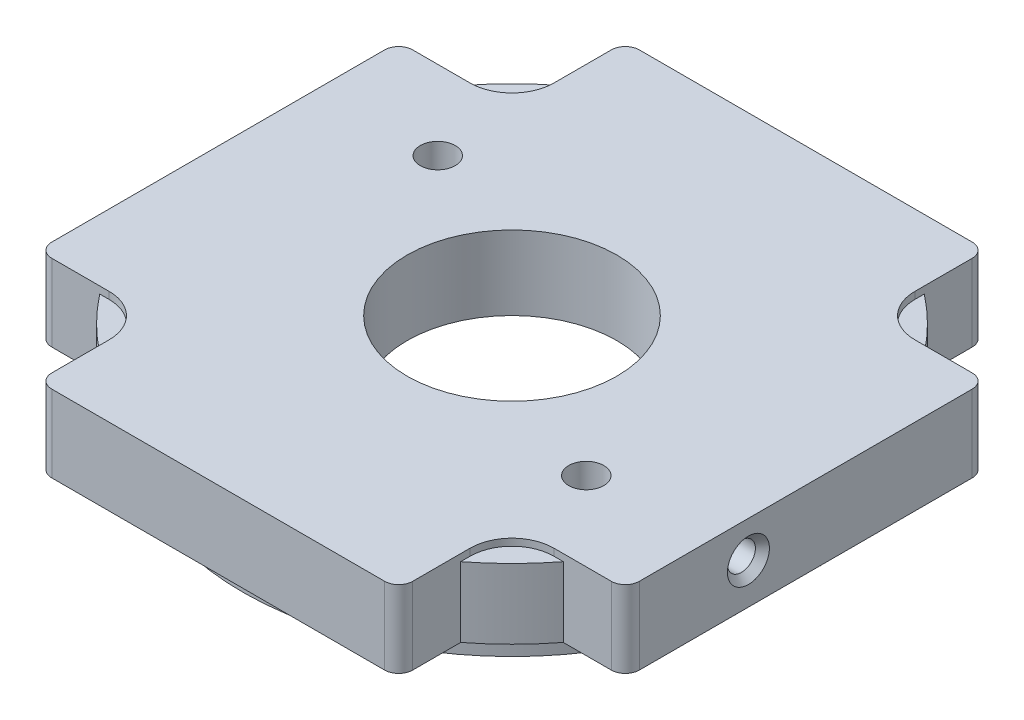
ISO-10303-21;
HEADER;
FILE_DESCRIPTION(('STEP AP214'),'2;1');
FILE_NAME('part.step','',(''),(''),'','','');
FILE_SCHEMA(('AUTOMOTIVE_DESIGN { 1 0 10303 214 1 1 1 1 }'));
ENDSEC;
DATA;
#1=APPLICATION_CONTEXT('core data for automotive mechanical design processes');
#2=APPLICATION_PROTOCOL_DEFINITION('international standard','automotive_design',2000,#1);
#3=PRODUCT_CONTEXT('',#1,'mechanical');
#4=PRODUCT('Part','Part','',(#3));
#5=PRODUCT_RELATED_PRODUCT_CATEGORY('part','',(#4));
#6=PRODUCT_DEFINITION_FORMATION('','',#4);
#7=PRODUCT_DEFINITION_CONTEXT('part definition',#1,'design');
#8=PRODUCT_DEFINITION('design','',#6,#7);
#9=PRODUCT_DEFINITION_SHAPE('','',#8);
#10=(LENGTH_UNIT() NAMED_UNIT(*) SI_UNIT(.MILLI.,.METRE.));
#11=(NAMED_UNIT(*) PLANE_ANGLE_UNIT() SI_UNIT($,.RADIAN.));
#12=(NAMED_UNIT(*) SI_UNIT($,.STERADIAN.) SOLID_ANGLE_UNIT());
#13=UNCERTAINTY_MEASURE_WITH_UNIT(LENGTH_MEASURE(1.E-05),#10,'distance_accuracy_value','');
#14=(GEOMETRIC_REPRESENTATION_CONTEXT(3) GLOBAL_UNCERTAINTY_ASSIGNED_CONTEXT((#13)) GLOBAL_UNIT_ASSIGNED_CONTEXT((#10,
#11,#12)) REPRESENTATION_CONTEXT('',''));
#15=CARTESIAN_POINT('',(0.,0.,0.));
#16=DIRECTION('',(0.,0.,1.));
#17=DIRECTION('',(1.,0.,0.));
#18=AXIS2_PLACEMENT_3D('',#15,#16,#17);
#19=CARTESIAN_POINT('',(-21.,2.,21.));
#20=DIRECTION('',(0.,-1.,0.));
#21=DIRECTION('',(0.,0.,-1.));
#22=AXIS2_PLACEMENT_3D('',#19,#20,#21);
#23=PLANE('',#22);
#24=DIRECTION('',(1.,0.,0.));
#25=VECTOR('',#24,1.);
#26=CARTESIAN_POINT('',(-21.,2.,-21.));
#27=LINE('',#26,#25);
#28=CARTESIAN_POINT('',(-11.9,2.,-21.));
#29=VERTEX_POINT('',#28);
#30=CARTESIAN_POINT('',(11.9,2.,-21.));
#31=VERTEX_POINT('',#30);
#32=EDGE_CURVE('E419',#29,#31,#27,.T.);
#33=ORIENTED_EDGE('',*,*,#32,.T.);
#34=CARTESIAN_POINT('',(11.9,2.,-20.));
#35=DIRECTION('',(0.,-1.,0.));
#36=DIRECTION('',(0.,0.,-1.));
#37=AXIS2_PLACEMENT_3D('',#34,#35,#36);
#38=CIRCLE('',#37,1.);
#39=CARTESIAN_POINT('',(12.9,2.,-20.));
#40=VERTEX_POINT('',#39);
#41=EDGE_CURVE('E457',#31,#40,#38,.T.);
#42=ORIENTED_EDGE('',*,*,#41,.T.);
#43=DIRECTION('',(0.,0.,-1.));
#44=VECTOR('',#43,1.);
#45=CARTESIAN_POINT('',(12.9,2.,-16.5707573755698));
#46=LINE('',#45,#44);
#47=CARTESIAN_POINT('',(12.9,2.,-16.5707573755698));
#48=VERTEX_POINT('',#47);
#49=EDGE_CURVE('E312',#48,#40,#46,.T.);
#50=ORIENTED_EDGE('',*,*,#49,.F.);
#51=CARTESIAN_POINT('',(0.,2.,0.));
#52=DIRECTION('',(0.,1.,0.));
#53=DIRECTION('',(0.,0.,1.));
#54=AXIS2_PLACEMENT_3D('',#51,#52,#53);
#55=CIRCLE('',#54,21.0000000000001);
#56=CARTESIAN_POINT('',(16.5707573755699,2.,-12.9));
#57=VERTEX_POINT('',#56);
#58=EDGE_CURVE('E316',#57,#48,#55,.T.);
#59=ORIENTED_EDGE('',*,*,#58,.F.);
#60=DIRECTION('',(-1.,0.,0.));
#61=VECTOR('',#60,1.);
#62=CARTESIAN_POINT('',(21.,2.,-12.9));
#63=LINE('',#62,#61);
#64=CARTESIAN_POINT('',(20.,2.,-12.9));
#65=VERTEX_POINT('',#64);
#66=EDGE_CURVE('E303',#65,#57,#63,.T.);
#67=ORIENTED_EDGE('',*,*,#66,.F.);
#68=CARTESIAN_POINT('',(20.,2.,-11.9));
#69=DIRECTION('',(0.,-1.,0.));
#70=DIRECTION('',(0.,0.,-1.));
#71=AXIS2_PLACEMENT_3D('',#68,#69,#70);
#72=CIRCLE('',#71,1.);
#73=CARTESIAN_POINT('',(21.,2.,-11.9));
#74=VERTEX_POINT('',#73);
#75=EDGE_CURVE('E449',#65,#74,#72,.T.);
#76=ORIENTED_EDGE('',*,*,#75,.T.);
#77=DIRECTION('',(0.,0.,1.));
#78=VECTOR('',#77,1.);
#79=CARTESIAN_POINT('',(21.,2.,-21.));
#80=LINE('',#79,#78);
#81=CARTESIAN_POINT('',(21.,2.,11.9));
#82=VERTEX_POINT('',#81);
#83=EDGE_CURVE('E406',#74,#82,#80,.T.);
#84=ORIENTED_EDGE('',*,*,#83,.T.);
#85=CARTESIAN_POINT('',(20.,2.,11.9));
#86=DIRECTION('',(0.,-1.,0.));
#87=DIRECTION('',(0.,0.,-1.));
#88=AXIS2_PLACEMENT_3D('',#85,#86,#87);
#89=CIRCLE('',#88,1.);
#90=CARTESIAN_POINT('',(20.,2.,12.9));
#91=VERTEX_POINT('',#90);
#92=EDGE_CURVE('E443',#82,#91,#89,.T.);
#93=ORIENTED_EDGE('',*,*,#92,.T.);
#94=DIRECTION('',(1.,0.,0.));
#95=VECTOR('',#94,1.);
#96=CARTESIAN_POINT('',(16.5707573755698,2.,12.9));
#97=LINE('',#96,#95);
#98=CARTESIAN_POINT('',(16.5707573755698,2.,12.9));
#99=VERTEX_POINT('',#98);
#100=EDGE_CURVE('E336',#99,#91,#97,.T.);
#101=ORIENTED_EDGE('',*,*,#100,.F.);
#102=CARTESIAN_POINT('',(0.,2.,0.));
#103=DIRECTION('',(0.,1.,0.));
#104=DIRECTION('',(0.,0.,1.));
#105=AXIS2_PLACEMENT_3D('',#102,#103,#104);
#106=CIRCLE('',#105,21.0000000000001);
#107=CARTESIAN_POINT('',(12.9,2.,16.5707573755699));
#108=VERTEX_POINT('',#107);
#109=EDGE_CURVE('E340',#108,#99,#106,.T.);
#110=ORIENTED_EDGE('',*,*,#109,.F.);
#111=DIRECTION('',(0.,0.,-1.));
#112=VECTOR('',#111,1.);
#113=CARTESIAN_POINT('',(12.9,2.,21.));
#114=LINE('',#113,#112);
#115=CARTESIAN_POINT('',(12.9,2.,20.));
#116=VERTEX_POINT('',#115);
#117=EDGE_CURVE('E329',#116,#108,#114,.T.);
#118=ORIENTED_EDGE('',*,*,#117,.F.);
#119=CARTESIAN_POINT('',(11.9,2.,20.));
#120=DIRECTION('',(0.,-1.,0.));
#121=DIRECTION('',(0.,0.,-1.));
#122=AXIS2_PLACEMENT_3D('',#119,#120,#121);
#123=CIRCLE('',#122,1.);
#124=CARTESIAN_POINT('',(11.9,2.,21.));
#125=VERTEX_POINT('',#124);
#126=EDGE_CURVE('E445',#116,#125,#123,.T.);
#127=ORIENTED_EDGE('',*,*,#126,.T.);
#128=DIRECTION('',(-1.,0.,0.));
#129=VECTOR('',#128,1.);
#130=CARTESIAN_POINT('',(21.,2.,21.));
#131=LINE('',#130,#129);
#132=CARTESIAN_POINT('',(-11.9,2.,21.));
#133=VERTEX_POINT('',#132);
#134=EDGE_CURVE('E399',#125,#133,#131,.T.);
#135=ORIENTED_EDGE('',*,*,#134,.T.);
#136=CARTESIAN_POINT('',(-11.9,2.,20.));
#137=DIRECTION('',(0.,-1.,0.));
#138=DIRECTION('',(0.,0.,-1.));
#139=AXIS2_PLACEMENT_3D('',#136,#137,#138);
#140=CIRCLE('',#139,1.);
#141=CARTESIAN_POINT('',(-12.9,2.,20.));
#142=VERTEX_POINT('',#141);
#143=EDGE_CURVE('E447',#133,#142,#140,.T.);
#144=ORIENTED_EDGE('',*,*,#143,.T.);
#145=DIRECTION('',(0.,0.,1.));
#146=VECTOR('',#145,1.);
#147=CARTESIAN_POINT('',(-12.9,2.,16.5707573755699));
#148=LINE('',#147,#146);
#149=CARTESIAN_POINT('',(-12.9,2.,16.5707573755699));
#150=VERTEX_POINT('',#149);
#151=EDGE_CURVE('E362',#150,#142,#148,.T.);
#152=ORIENTED_EDGE('',*,*,#151,.F.);
#153=CARTESIAN_POINT('',(0.,2.,0.));
#154=DIRECTION('',(0.,1.,0.));
#155=DIRECTION('',(0.,0.,1.));
#156=AXIS2_PLACEMENT_3D('',#153,#154,#155);
#157=CIRCLE('',#156,21.0000000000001);
#158=CARTESIAN_POINT('',(-16.5707573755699,2.,12.9));
#159=VERTEX_POINT('',#158);
#160=EDGE_CURVE('E366',#159,#150,#157,.T.);
#161=ORIENTED_EDGE('',*,*,#160,.F.);
#162=DIRECTION('',(1.,0.,0.));
#163=VECTOR('',#162,1.);
#164=CARTESIAN_POINT('',(-21.,2.,12.9));
#165=LINE('',#164,#163);
#166=CARTESIAN_POINT('',(-20.,2.,12.9));
#167=VERTEX_POINT('',#166);
#168=EDGE_CURVE('E353',#167,#159,#165,.T.);
#169=ORIENTED_EDGE('',*,*,#168,.F.);
#170=CARTESIAN_POINT('',(-20.,2.,11.9));
#171=DIRECTION('',(0.,-1.,0.));
#172=DIRECTION('',(0.,0.,-1.));
#173=AXIS2_PLACEMENT_3D('',#170,#171,#172);
#174=CIRCLE('',#173,1.);
#175=CARTESIAN_POINT('',(-21.,2.,11.9));
#176=VERTEX_POINT('',#175);
#177=EDGE_CURVE('E453',#167,#176,#174,.T.);
#178=ORIENTED_EDGE('',*,*,#177,.T.);
#179=DIRECTION('',(0.,0.,-1.));
#180=VECTOR('',#179,1.);
#181=CARTESIAN_POINT('',(-21.,2.,21.));
#182=LINE('',#181,#180);
#183=CARTESIAN_POINT('',(-21.,2.,-11.8999999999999));
#184=VERTEX_POINT('',#183);
#185=EDGE_CURVE('E416',#176,#184,#182,.T.);
#186=ORIENTED_EDGE('',*,*,#185,.T.);
#187=CARTESIAN_POINT('',(-20.,2.,-11.9));
#188=DIRECTION('',(0.,-1.,0.));
#189=DIRECTION('',(0.,0.,-1.));
#190=AXIS2_PLACEMENT_3D('',#187,#188,#189);
#191=CIRCLE('',#190,1.);
#192=CARTESIAN_POINT('',(-20.,2.,-12.9));
#193=VERTEX_POINT('',#192);
#194=EDGE_CURVE('E451',#184,#193,#191,.T.);
#195=ORIENTED_EDGE('',*,*,#194,.T.);
#196=DIRECTION('',(-1.,0.,0.));
#197=VECTOR('',#196,1.);
#198=CARTESIAN_POINT('',(-16.5707573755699,2.,-12.9));
#199=LINE('',#198,#197);
#200=CARTESIAN_POINT('',(-16.5707573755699,2.,-12.9));
#201=VERTEX_POINT('',#200);
#202=EDGE_CURVE('E388',#201,#193,#199,.T.);
#203=ORIENTED_EDGE('',*,*,#202,.F.);
#204=CARTESIAN_POINT('',(0.,2.,0.));
#205=DIRECTION('',(0.,1.,0.));
#206=DIRECTION('',(0.,0.,1.));
#207=AXIS2_PLACEMENT_3D('',#204,#205,#206);
#208=CIRCLE('',#207,21.0000000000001);
#209=CARTESIAN_POINT('',(-12.9,2.,-16.5707573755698));
#210=VERTEX_POINT('',#209);
#211=EDGE_CURVE('E392',#210,#201,#208,.T.);
#212=ORIENTED_EDGE('',*,*,#211,.F.);
#213=DIRECTION('',(0.,0.,1.));
#214=VECTOR('',#213,1.);
#215=CARTESIAN_POINT('',(-12.9,2.,-21.));
#216=LINE('',#215,#214);
#217=CARTESIAN_POINT('',(-12.9,2.,-20.));
#218=VERTEX_POINT('',#217);
#219=EDGE_CURVE('E379',#218,#210,#216,.T.);
#220=ORIENTED_EDGE('',*,*,#219,.F.);
#221=CARTESIAN_POINT('',(-11.9,2.,-20.));
#222=DIRECTION('',(0.,-1.,0.));
#223=DIRECTION('',(0.,0.,-1.));
#224=AXIS2_PLACEMENT_3D('',#221,#222,#223);
#225=CIRCLE('',#224,1.);
#226=EDGE_CURVE('E455',#218,#29,#225,.T.);
#227=ORIENTED_EDGE('',*,*,#226,.T.);
#228=EDGE_LOOP('',(#33,#42,#50,#59,#67,#76,#84,#93,#101,#110,#118,#127,#135,#144,#152,#161,#169,
#178,#186,#195,#203,#212,#220,#227));
#229=FACE_BOUND('',#228,.T.);
#230=DIRECTION('',(-1.,0.,-1.75170641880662E-13));
#231=VECTOR('',#230,1.);
#232=CARTESIAN_POINT('',(17.3931739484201,2.,-2.99999999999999));
#233=LINE('',#232,#231);
#234=CARTESIAN_POINT('',(19.0147968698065,2.,-2.9999999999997));
#235=VERTEX_POINT('',#234);
#236=CARTESIAN_POINT('',(17.3931739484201,2.,-2.99999999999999));
#237=VERTEX_POINT('',#236);
#238=EDGE_CURVE('E290',#235,#237,#233,.T.);
#239=ORIENTED_EDGE('',*,*,#238,.F.);
#240=CARTESIAN_POINT('',(0.,2.,0.));
#241=DIRECTION('',(0.,-1.,0.));
#242=DIRECTION('',(0.,0.,1.));
#243=AXIS2_PLACEMENT_3D('',#240,#241,#242);
#244=CIRCLE('',#243,19.25);
#245=CARTESIAN_POINT('',(19.0147968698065,2.,2.99999999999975));
#246=VERTEX_POINT('',#245);
#247=EDGE_CURVE('E1088',#246,#235,#244,.T.);
#248=ORIENTED_EDGE('',*,*,#247,.F.);
#249=DIRECTION('',(1.,0.,-1.69555992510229E-13));
#250=VECTOR('',#249,1.);
#251=CARTESIAN_POINT('',(19.0147968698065,2.,2.99999999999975));
#252=LINE('',#251,#250);
#253=CARTESIAN_POINT('',(17.3931739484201,2.,3.00000000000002));
#254=VERTEX_POINT('',#253);
#255=EDGE_CURVE('E1097',#254,#246,#252,.T.);
#256=ORIENTED_EDGE('',*,*,#255,.F.);
#257=CARTESIAN_POINT('',(0.,2.,0.));
#258=DIRECTION('',(0.,-1.,0.));
#259=DIRECTION('',(0.,0.,1.));
#260=AXIS2_PLACEMENT_3D('',#257,#258,#259);
#261=CIRCLE('',#260,17.65);
#262=EDGE_CURVE('E1101',#237,#254,#261,.T.);
#263=ORIENTED_EDGE('',*,*,#262,.F.);
#264=EDGE_LOOP('',(#239,#248,#256,#263));
#265=FACE_BOUND('',#264,.T.);
#266=ADVANCED_FACE('F34',(#229,#265),#23,.T.);
#267=CARTESIAN_POINT('',(21.,7.49999999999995,21.));
#268=DIRECTION('',(0.,0.,1.));
#269=DIRECTION('',(1.,0.,0.));
#270=AXIS2_PLACEMENT_3D('',#267,#268,#269);
#271=PLANE('',#270);
#272=DIRECTION('',(-1.,0.,0.));
#273=VECTOR('',#272,1.);
#274=CARTESIAN_POINT('',(21.,7.49999999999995,21.));
#275=LINE('',#274,#273);
#276=CARTESIAN_POINT('',(11.9,7.49999999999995,21.));
#277=VERTEX_POINT('',#276);
#278=CARTESIAN_POINT('',(-11.9,7.49999999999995,21.));
#279=VERTEX_POINT('',#278);
#280=EDGE_CURVE('E402',#277,#279,#275,.T.);
#281=ORIENTED_EDGE('',*,*,#280,.T.);
#282=DIRECTION('',(0.,-1.,0.));
#283=VECTOR('',#282,1.);
#284=CARTESIAN_POINT('',(-11.9,2.,21.));
#285=LINE('',#284,#283);
#286=EDGE_CURVE('E502',#279,#133,#285,.T.);
#287=ORIENTED_EDGE('',*,*,#286,.T.);
#288=ORIENTED_EDGE('',*,*,#134,.F.);
#289=DIRECTION('',(0.,-1.,0.));
#290=VECTOR('',#289,1.);
#291=CARTESIAN_POINT('',(11.9,7.49999999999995,21.));
#292=LINE('',#291,#290);
#293=EDGE_CURVE('E500',#125,#277,#292,.F.);
#294=ORIENTED_EDGE('',*,*,#293,.T.);
#295=EDGE_LOOP('',(#281,#287,#288,#294));
#296=FACE_BOUND('',#295,.T.);
#297=ADVANCED_FACE('F577',(#296),#271,.T.);
#298=CARTESIAN_POINT('',(21.,7.49999999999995,-21.));
#299=DIRECTION('',(1.,0.,0.));
#300=DIRECTION('',(0.,0.,-1.));
#301=AXIS2_PLACEMENT_3D('',#298,#299,#300);
#302=PLANE('',#301);
#303=CARTESIAN_POINT('',(21.,4.90000000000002,4.1));
#304=DIRECTION('',(1.,0.,0.));
#305=DIRECTION('',(0.,0.,-1.));
#306=AXIS2_PLACEMENT_3D('',#303,#304,#305);
#307=CIRCLE('',#306,1.50003813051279);
#308=CARTESIAN_POINT('',(21.,4.90000000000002,2.59996186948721));
#309=VERTEX_POINT('',#308);
#310=EDGE_CURVE('E435',#309,#309,#307,.F.);
#311=ORIENTED_EDGE('',*,*,#310,.T.);
#312=EDGE_LOOP('',(#311));
#313=FACE_BOUND('',#312,.T.);
#314=ORIENTED_EDGE('',*,*,#83,.F.);
#315=DIRECTION('',(0.,-1.,0.));
#316=VECTOR('',#315,1.);
#317=CARTESIAN_POINT('',(21.,7.49999999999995,-11.9));
#318=LINE('',#317,#316);
#319=CARTESIAN_POINT('',(21.,7.49999999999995,-11.9));
#320=VERTEX_POINT('',#319);
#321=EDGE_CURVE('E498',#74,#320,#318,.F.);
#322=ORIENTED_EDGE('',*,*,#321,.T.);
#323=DIRECTION('',(0.,0.,1.));
#324=VECTOR('',#323,1.);
#325=CARTESIAN_POINT('',(21.,7.49999999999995,-21.));
#326=LINE('',#325,#324);
#327=CARTESIAN_POINT('',(21.,7.49999999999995,11.9));
#328=VERTEX_POINT('',#327);
#329=EDGE_CURVE('E277',#320,#328,#326,.T.);
#330=ORIENTED_EDGE('',*,*,#329,.T.);
#331=DIRECTION('',(0.,-1.,0.));
#332=VECTOR('',#331,1.);
#333=CARTESIAN_POINT('',(21.,2.,11.9));
#334=LINE('',#333,#332);
#335=EDGE_CURVE('E495',#328,#82,#334,.T.);
#336=ORIENTED_EDGE('',*,*,#335,.T.);
#337=EDGE_LOOP('',(#314,#322,#330,#336));
#338=FACE_BOUND('',#337,.T.);
#339=ADVANCED_FACE('F607',(#313,#338),#302,.T.);
#340=CARTESIAN_POINT('',(-21.,7.49999999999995,-21.));
#341=DIRECTION('',(0.,0.,-1.));
#342=DIRECTION('',(-1.,0.,0.));
#343=AXIS2_PLACEMENT_3D('',#340,#341,#342);
#344=PLANE('',#343);
#345=DIRECTION('',(1.,0.,0.));
#346=VECTOR('',#345,1.);
#347=CARTESIAN_POINT('',(-21.,7.49999999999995,-21.));
#348=LINE('',#347,#346);
#349=CARTESIAN_POINT('',(-11.9,7.49999999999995,-21.));
#350=VERTEX_POINT('',#349);
#351=CARTESIAN_POINT('',(11.9,7.49999999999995,-21.));
#352=VERTEX_POINT('',#351);
#353=EDGE_CURVE('E409',#350,#352,#348,.T.);
#354=ORIENTED_EDGE('',*,*,#353,.T.);
#355=DIRECTION('',(0.,-1.,0.));
#356=VECTOR('',#355,1.);
#357=CARTESIAN_POINT('',(11.9,2.,-21.));
#358=LINE('',#357,#356);
#359=EDGE_CURVE('E440',#352,#31,#358,.T.);
#360=ORIENTED_EDGE('',*,*,#359,.T.);
#361=ORIENTED_EDGE('',*,*,#32,.F.);
#362=DIRECTION('',(0.,-1.,0.));
#363=VECTOR('',#362,1.);
#364=CARTESIAN_POINT('',(-11.9,7.49999999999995,-21.));
#365=LINE('',#364,#363);
#366=EDGE_CURVE('E438',#29,#350,#365,.F.);
#367=ORIENTED_EDGE('',*,*,#366,.T.);
#368=EDGE_LOOP('',(#354,#360,#361,#367));
#369=FACE_BOUND('',#368,.T.);
#370=ADVANCED_FACE('F635',(#369),#344,.T.);
#371=CARTESIAN_POINT('',(-21.,7.49999999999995,21.));
#372=DIRECTION('',(-1.,0.,0.));
#373=DIRECTION('',(0.,0.,1.));
#374=AXIS2_PLACEMENT_3D('',#371,#372,#373);
#375=PLANE('',#374);
#376=ORIENTED_EDGE('',*,*,#185,.F.);
#377=DIRECTION('',(0.,-1.,0.));
#378=VECTOR('',#377,1.);
#379=CARTESIAN_POINT('',(-21.,7.49999999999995,11.9));
#380=LINE('',#379,#378);
#381=CARTESIAN_POINT('',(-21.,7.49999999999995,11.9));
#382=VERTEX_POINT('',#381);
#383=EDGE_CURVE('E487',#176,#382,#380,.F.);
#384=ORIENTED_EDGE('',*,*,#383,.T.);
#385=DIRECTION('',(0.,0.,-1.));
#386=VECTOR('',#385,1.);
#387=CARTESIAN_POINT('',(-21.,7.49999999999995,21.));
#388=LINE('',#387,#386);
#389=CARTESIAN_POINT('',(-21.,7.49999999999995,-11.8999999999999));
#390=VERTEX_POINT('',#389);
#391=EDGE_CURVE('E405',#382,#390,#388,.T.);
#392=ORIENTED_EDGE('',*,*,#391,.T.);
#393=DIRECTION('',(0.,-1.,0.));
#394=VECTOR('',#393,1.);
#395=CARTESIAN_POINT('',(-21.,2.,-11.9));
#396=LINE('',#395,#394);
#397=EDGE_CURVE('E484',#390,#184,#396,.T.);
#398=ORIENTED_EDGE('',*,*,#397,.T.);
#399=EDGE_LOOP('',(#376,#384,#392,#398));
#400=FACE_BOUND('',#399,.T.);
#401=ADVANCED_FACE('F665',(#400),#375,.T.);
#402=CARTESIAN_POINT('',(-21.,7.49999999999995,21.));
#403=DIRECTION('',(0.,-1.,0.));
#404=DIRECTION('',(0.,0.,-1.));
#405=AXIS2_PLACEMENT_3D('',#402,#403,#404);
#406=PLANE('',#405);
#407=CARTESIAN_POINT('',(-12.55736835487,7.49999999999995,-7.25));
#408=DIRECTION('',(0.,1.,0.));
#409=DIRECTION('',(0.,0.,1.));
#410=AXIS2_PLACEMENT_3D('',#407,#408,#409);
#411=CIRCLE('',#410,1.24999999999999);
#412=CARTESIAN_POINT('',(-12.55736835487,7.49999999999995,-6.00000000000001));
#413=VERTEX_POINT('',#412);
#414=EDGE_CURVE('E432',#413,#413,#411,.T.);
#415=ORIENTED_EDGE('',*,*,#414,.F.);
#416=EDGE_LOOP('',(#415));
#417=FACE_BOUND('',#416,.T.);
#418=CARTESIAN_POINT('',(12.55736835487,7.49999999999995,7.25));
#419=DIRECTION('',(0.,1.,0.));
#420=DIRECTION('',(0.,0.,1.));
#421=AXIS2_PLACEMENT_3D('',#418,#419,#420);
#422=CIRCLE('',#421,1.24999999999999);
#423=CARTESIAN_POINT('',(12.55736835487,7.49999999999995,8.49999999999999));
#424=VERTEX_POINT('',#423);
#425=EDGE_CURVE('E428',#424,#424,#422,.T.);
#426=ORIENTED_EDGE('',*,*,#425,.F.);
#427=EDGE_LOOP('',(#426));
#428=FACE_BOUND('',#427,.T.);
#429=CARTESIAN_POINT('',(0.,7.49999999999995,0.));
#430=DIRECTION('',(0.,-1.,0.));
#431=DIRECTION('',(0.,0.,-1.));
#432=AXIS2_PLACEMENT_3D('',#429,#430,#431);
#433=CIRCLE('',#432,7.5);
#434=CARTESIAN_POINT('',(0.,7.49999999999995,-7.5));
#435=VERTEX_POINT('',#434);
#436=EDGE_CURVE('E1087',#435,#435,#433,.T.);
#437=ORIENTED_EDGE('',*,*,#436,.T.);
#438=EDGE_LOOP('',(#437));
#439=FACE_BOUND('',#438,.T.);
#440=DIRECTION('',(-1.,0.,0.));
#441=VECTOR('',#440,1.);
#442=CARTESIAN_POINT('',(21.,7.49999999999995,-12.9));
#443=LINE('',#442,#441);
#444=CARTESIAN_POINT('',(20.,7.49999999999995,-12.9));
#445=VERTEX_POINT('',#444);
#446=CARTESIAN_POINT('',(15.9,7.49999999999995,-12.9));
#447=VERTEX_POINT('',#446);
#448=EDGE_CURVE('E308',#445,#447,#443,.T.);
#449=ORIENTED_EDGE('',*,*,#448,.T.);
#450=CARTESIAN_POINT('',(15.9,7.49999999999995,-15.9));
#451=DIRECTION('',(0.,-1.,0.));
#452=DIRECTION('',(0.,0.,-1.));
#453=AXIS2_PLACEMENT_3D('',#450,#451,#452);
#454=CIRCLE('',#453,3.);
#455=CARTESIAN_POINT('',(12.9,7.49999999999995,-15.9));
#456=VERTEX_POINT('',#455);
#457=EDGE_CURVE('E542',#447,#456,#454,.T.);
#458=ORIENTED_EDGE('',*,*,#457,.T.);
#459=DIRECTION('',(0.,0.,-1.));
#460=VECTOR('',#459,1.);
#461=CARTESIAN_POINT('',(12.9,7.49999999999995,-16.5707573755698));
#462=LINE('',#461,#460);
#463=CARTESIAN_POINT('',(12.9,7.49999999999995,-20.));
#464=VERTEX_POINT('',#463);
#465=EDGE_CURVE('E311',#456,#464,#462,.T.);
#466=ORIENTED_EDGE('',*,*,#465,.T.);
#467=CARTESIAN_POINT('',(11.9,7.49999999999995,-20.));
#468=DIRECTION('',(0.,-1.,0.));
#469=DIRECTION('',(0.,0.,-1.));
#470=AXIS2_PLACEMENT_3D('',#467,#468,#469);
#471=CIRCLE('',#470,1.);
#472=EDGE_CURVE('E476',#464,#352,#471,.F.);
#473=ORIENTED_EDGE('',*,*,#472,.T.);
#474=ORIENTED_EDGE('',*,*,#353,.F.);
#475=CARTESIAN_POINT('',(-11.9,7.49999999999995,-20.));
#476=DIRECTION('',(0.,-1.,0.));
#477=DIRECTION('',(0.,0.,-1.));
#478=AXIS2_PLACEMENT_3D('',#475,#476,#477);
#479=CIRCLE('',#478,1.);
#480=CARTESIAN_POINT('',(-12.9,7.49999999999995,-20.));
#481=VERTEX_POINT('',#480);
#482=EDGE_CURVE('E474',#350,#481,#479,.F.);
#483=ORIENTED_EDGE('',*,*,#482,.T.);
#484=DIRECTION('',(0.,0.,1.));
#485=VECTOR('',#484,1.);
#486=CARTESIAN_POINT('',(-12.9,7.49999999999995,-21.));
#487=LINE('',#486,#485);
#488=CARTESIAN_POINT('',(-12.9,7.49999999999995,-15.9));
#489=VERTEX_POINT('',#488);
#490=EDGE_CURVE('E384',#481,#489,#487,.T.);
#491=ORIENTED_EDGE('',*,*,#490,.T.);
#492=CARTESIAN_POINT('',(-15.9,7.49999999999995,-15.9));
#493=DIRECTION('',(0.,-1.,0.));
#494=DIRECTION('',(0.,0.,-1.));
#495=AXIS2_PLACEMENT_3D('',#492,#493,#494);
#496=CIRCLE('',#495,3.);
#497=CARTESIAN_POINT('',(-15.9,7.49999999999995,-12.9));
#498=VERTEX_POINT('',#497);
#499=EDGE_CURVE('E540',#489,#498,#496,.T.);
#500=ORIENTED_EDGE('',*,*,#499,.T.);
#501=DIRECTION('',(-1.,0.,0.));
#502=VECTOR('',#501,1.);
#503=CARTESIAN_POINT('',(-16.5707573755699,7.49999999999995,-12.9));
#504=LINE('',#503,#502);
#505=CARTESIAN_POINT('',(-20.,7.49999999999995,-12.9));
#506=VERTEX_POINT('',#505);
#507=EDGE_CURVE('E387',#498,#506,#504,.T.);
#508=ORIENTED_EDGE('',*,*,#507,.T.);
#509=CARTESIAN_POINT('',(-20.,7.49999999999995,-11.9));
#510=DIRECTION('',(0.,-1.,0.));
#511=DIRECTION('',(0.,0.,-1.));
#512=AXIS2_PLACEMENT_3D('',#509,#510,#511);
#513=CIRCLE('',#512,1.);
#514=EDGE_CURVE('E470',#506,#390,#513,.F.);
#515=ORIENTED_EDGE('',*,*,#514,.T.);
#516=ORIENTED_EDGE('',*,*,#391,.F.);
#517=CARTESIAN_POINT('',(-20.,7.49999999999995,11.9));
#518=DIRECTION('',(0.,-1.,0.));
#519=DIRECTION('',(0.,0.,-1.));
#520=AXIS2_PLACEMENT_3D('',#517,#518,#519);
#521=CIRCLE('',#520,1.);
#522=CARTESIAN_POINT('',(-20.,7.49999999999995,12.9));
#523=VERTEX_POINT('',#522);
#524=EDGE_CURVE('E472',#382,#523,#521,.F.);
#525=ORIENTED_EDGE('',*,*,#524,.T.);
#526=DIRECTION('',(1.,0.,0.));
#527=VECTOR('',#526,1.);
#528=CARTESIAN_POINT('',(-21.,7.49999999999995,12.9));
#529=LINE('',#528,#527);
#530=CARTESIAN_POINT('',(-15.9,7.49999999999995,12.9));
#531=VERTEX_POINT('',#530);
#532=EDGE_CURVE('E358',#523,#531,#529,.T.);
#533=ORIENTED_EDGE('',*,*,#532,.T.);
#534=CARTESIAN_POINT('',(-15.9,7.49999999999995,15.9));
#535=DIRECTION('',(0.,-1.,0.));
#536=DIRECTION('',(0.,0.,-1.));
#537=AXIS2_PLACEMENT_3D('',#534,#535,#536);
#538=CIRCLE('',#537,3.);
#539=CARTESIAN_POINT('',(-12.9,7.49999999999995,15.9));
#540=VERTEX_POINT('',#539);
#541=EDGE_CURVE('E42',#531,#540,#538,.T.);
#542=ORIENTED_EDGE('',*,*,#541,.T.);
#543=DIRECTION('',(0.,0.,1.));
#544=VECTOR('',#543,1.);
#545=CARTESIAN_POINT('',(-12.9,7.49999999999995,16.5707573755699));
#546=LINE('',#545,#544);
#547=CARTESIAN_POINT('',(-12.9,7.49999999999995,20.));
#548=VERTEX_POINT('',#547);
#549=EDGE_CURVE('E361',#540,#548,#546,.T.);
#550=ORIENTED_EDGE('',*,*,#549,.T.);
#551=CARTESIAN_POINT('',(-11.9,7.49999999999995,20.));
#552=DIRECTION('',(0.,-1.,0.));
#553=DIRECTION('',(0.,0.,-1.));
#554=AXIS2_PLACEMENT_3D('',#551,#552,#553);
#555=CIRCLE('',#554,1.);
#556=EDGE_CURVE('E466',#548,#279,#555,.F.);
#557=ORIENTED_EDGE('',*,*,#556,.T.);
#558=ORIENTED_EDGE('',*,*,#280,.F.);
#559=CARTESIAN_POINT('',(11.9,7.49999999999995,20.));
#560=DIRECTION('',(0.,-1.,0.));
#561=DIRECTION('',(0.,0.,-1.));
#562=AXIS2_PLACEMENT_3D('',#559,#560,#561);
#563=CIRCLE('',#562,1.);
#564=CARTESIAN_POINT('',(12.9,7.49999999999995,20.));
#565=VERTEX_POINT('',#564);
#566=EDGE_CURVE('E464',#277,#565,#563,.F.);
#567=ORIENTED_EDGE('',*,*,#566,.T.);
#568=DIRECTION('',(0.,0.,-1.));
#569=VECTOR('',#568,1.);
#570=CARTESIAN_POINT('',(12.9,7.49999999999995,21.));
#571=LINE('',#570,#569);
#572=CARTESIAN_POINT('',(12.9,7.49999999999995,15.9));
#573=VERTEX_POINT('',#572);
#574=EDGE_CURVE('E333',#565,#573,#571,.T.);
#575=ORIENTED_EDGE('',*,*,#574,.T.);
#576=CARTESIAN_POINT('',(15.9,7.49999999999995,15.9));
#577=DIRECTION('',(0.,-1.,0.));
#578=DIRECTION('',(0.,0.,-1.));
#579=AXIS2_PLACEMENT_3D('',#576,#577,#578);
#580=CIRCLE('',#579,3.);
#581=CARTESIAN_POINT('',(15.9,7.49999999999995,12.9));
#582=VERTEX_POINT('',#581);
#583=EDGE_CURVE('E11',#573,#582,#580,.T.);
#584=ORIENTED_EDGE('',*,*,#583,.T.);
#585=DIRECTION('',(1.,0.,0.));
#586=VECTOR('',#585,1.);
#587=CARTESIAN_POINT('',(16.5707573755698,7.49999999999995,12.9));
#588=LINE('',#587,#586);
#589=CARTESIAN_POINT('',(20.,7.49999999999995,12.9));
#590=VERTEX_POINT('',#589);
#591=EDGE_CURVE('E335',#582,#590,#588,.T.);
#592=ORIENTED_EDGE('',*,*,#591,.T.);
#593=CARTESIAN_POINT('',(20.,7.49999999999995,11.9));
#594=DIRECTION('',(0.,-1.,0.));
#595=DIRECTION('',(0.,0.,-1.));
#596=AXIS2_PLACEMENT_3D('',#593,#594,#595);
#597=CIRCLE('',#596,1.);
#598=EDGE_CURVE('E462',#590,#328,#597,.F.);
#599=ORIENTED_EDGE('',*,*,#598,.T.);
#600=ORIENTED_EDGE('',*,*,#329,.F.);
#601=CARTESIAN_POINT('',(20.,7.49999999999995,-11.9));
#602=DIRECTION('',(0.,-1.,0.));
#603=DIRECTION('',(0.,0.,-1.));
#604=AXIS2_PLACEMENT_3D('',#601,#602,#603);
#605=CIRCLE('',#604,1.);
#606=EDGE_CURVE('E468',#320,#445,#605,.F.);
#607=ORIENTED_EDGE('',*,*,#606,.T.);
#608=EDGE_LOOP('',(#449,#458,#466,#473,#474,#483,#491,#500,#508,#515,#516,#525,#533,#542,#550,
#557,#558,#567,#575,#584,#592,#599,#600,#607));
#609=FACE_BOUND('',#608,.T.);
#610=ADVANCED_FACE('F546',(#417,#428,#439,#609),#406,.F.);
#611=CARTESIAN_POINT('',(-16.5707573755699,7.49999999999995,-12.9));
#612=DIRECTION('',(0.,0.,1.));
#613=DIRECTION('',(1.,0.,0.));
#614=AXIS2_PLACEMENT_3D('',#611,#612,#613);
#615=PLANE('',#614);
#616=ORIENTED_EDGE('',*,*,#507,.F.);
#617=DIRECTION('',(0.,-1.,0.));
#618=VECTOR('',#617,1.);
#619=CARTESIAN_POINT('',(-15.9,7.00000000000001,-12.9));
#620=LINE('',#619,#618);
#621=CARTESIAN_POINT('',(-15.9,7.00000000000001,-12.9));
#622=VERTEX_POINT('',#621);
#623=EDGE_CURVE('E514',#498,#622,#620,.T.);
#624=ORIENTED_EDGE('',*,*,#623,.T.);
#625=DIRECTION('',(-1.,0.,0.));
#626=VECTOR('',#625,1.);
#627=CARTESIAN_POINT('',(-12.9,7.00000000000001,-12.9));
#628=LINE('',#627,#626);
#629=CARTESIAN_POINT('',(-16.5707573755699,7.00000000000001,-12.9));
#630=VERTEX_POINT('',#629);
#631=EDGE_CURVE('E380',#622,#630,#628,.T.);
#632=ORIENTED_EDGE('',*,*,#631,.T.);
#633=DIRECTION('',(0.,-1.,0.));
#634=VECTOR('',#633,1.);
#635=CARTESIAN_POINT('',(-16.5707573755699,7.49999999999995,-12.9));
#636=LINE('',#635,#634);
#637=EDGE_CURVE('E397',#630,#201,#636,.T.);
#638=ORIENTED_EDGE('',*,*,#637,.T.);
#639=ORIENTED_EDGE('',*,*,#202,.T.);
#640=DIRECTION('',(0.,-1.,0.));
#641=VECTOR('',#640,1.);
#642=CARTESIAN_POINT('',(-20.,7.49999999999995,-12.9));
#643=LINE('',#642,#641);
#644=EDGE_CURVE('E489',#193,#506,#643,.F.);
#645=ORIENTED_EDGE('',*,*,#644,.T.);
#646=EDGE_LOOP('',(#616,#624,#632,#638,#639,#645));
#647=FACE_BOUND('',#646,.T.);
#648=ADVANCED_FACE('F653',(#647),#615,.F.);
#649=CARTESIAN_POINT('',(0.,7.49999999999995,0.));
#650=DIRECTION('',(0.,-1.,0.));
#651=DIRECTION('',(0.,0.,-1.));
#652=AXIS2_PLACEMENT_3D('',#649,#650,#651);
#653=CYLINDRICAL_SURFACE('',#652,21.0000000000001);
#654=ORIENTED_EDGE('',*,*,#637,.F.);
#655=CARTESIAN_POINT('',(0.,7.00000000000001,0.));
#656=DIRECTION('',(0.,-1.,0.));
#657=DIRECTION('',(0.,0.,-1.));
#658=AXIS2_PLACEMENT_3D('',#655,#656,#657);
#659=CIRCLE('',#658,21.0000000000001);
#660=CARTESIAN_POINT('',(-12.9,7.00000000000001,-16.5707573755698));
#661=VERTEX_POINT('',#660);
#662=EDGE_CURVE('E376',#630,#661,#659,.T.);
#663=ORIENTED_EDGE('',*,*,#662,.T.);
#664=DIRECTION('',(0.,-1.,0.));
#665=VECTOR('',#664,1.);
#666=CARTESIAN_POINT('',(-12.9,7.49999999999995,-16.5707573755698));
#667=LINE('',#666,#665);
#668=EDGE_CURVE('E390',#661,#210,#667,.T.);
#669=ORIENTED_EDGE('',*,*,#668,.T.);
#670=ORIENTED_EDGE('',*,*,#211,.T.);
#671=EDGE_LOOP('',(#654,#663,#669,#670));
#672=FACE_BOUND('',#671,.T.);
#673=ADVANCED_FACE('F673',(#672),#653,.T.);
#674=CARTESIAN_POINT('',(-12.9,7.49999999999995,-21.));
#675=DIRECTION('',(1.,0.,0.));
#676=DIRECTION('',(0.,0.,-1.));
#677=AXIS2_PLACEMENT_3D('',#674,#675,#676);
#678=PLANE('',#677);
#679=DIRECTION('',(0.,0.,1.));
#680=VECTOR('',#679,1.);
#681=CARTESIAN_POINT('',(-12.9,7.00000000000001,-16.5707573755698));
#682=LINE('',#681,#680);
#683=CARTESIAN_POINT('',(-12.9,7.00000000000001,-15.9));
#684=VERTEX_POINT('',#683);
#685=EDGE_CURVE('E373',#661,#684,#682,.T.);
#686=ORIENTED_EDGE('',*,*,#685,.T.);
#687=DIRECTION('',(0.,-1.,0.));
#688=VECTOR('',#687,1.);
#689=CARTESIAN_POINT('',(-12.9,7.49999999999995,-15.9));
#690=LINE('',#689,#688);
#691=EDGE_CURVE('E519',#684,#489,#690,.F.);
#692=ORIENTED_EDGE('',*,*,#691,.T.);
#693=ORIENTED_EDGE('',*,*,#490,.F.);
#694=DIRECTION('',(0.,-1.,0.));
#695=VECTOR('',#694,1.);
#696=CARTESIAN_POINT('',(-12.9,2.,-20.));
#697=LINE('',#696,#695);
#698=EDGE_CURVE('E478',#481,#218,#697,.T.);
#699=ORIENTED_EDGE('',*,*,#698,.T.);
#700=ORIENTED_EDGE('',*,*,#219,.T.);
#701=ORIENTED_EDGE('',*,*,#668,.F.);
#702=EDGE_LOOP('',(#686,#692,#693,#699,#700,#701));
#703=FACE_BOUND('',#702,.T.);
#704=ADVANCED_FACE('F644',(#703),#678,.F.);
#705=CARTESIAN_POINT('',(0.,7.00000000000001,0.));
#706=DIRECTION('',(0.,-1.,0.));
#707=DIRECTION('',(0.,0.,-1.));
#708=AXIS2_PLACEMENT_3D('',#705,#706,#707);
#709=PLANE('',#708);
#710=ORIENTED_EDGE('',*,*,#631,.F.);
#711=CARTESIAN_POINT('',(-15.9,7.00000000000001,-15.9));
#712=DIRECTION('',(0.,-1.,0.));
#713=DIRECTION('',(0.,0.,-1.));
#714=AXIS2_PLACEMENT_3D('',#711,#712,#713);
#715=CIRCLE('',#714,3.);
#716=EDGE_CURVE('E517',#622,#684,#715,.F.);
#717=ORIENTED_EDGE('',*,*,#716,.T.);
#718=ORIENTED_EDGE('',*,*,#685,.F.);
#719=ORIENTED_EDGE('',*,*,#662,.F.);
#720=EDGE_LOOP('',(#710,#717,#718,#719));
#721=FACE_BOUND('',#720,.T.);
#722=ADVANCED_FACE('F676',(#721),#709,.F.);
#723=CARTESIAN_POINT('',(-12.9,7.49999999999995,16.5707573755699));
#724=DIRECTION('',(1.,0.,0.));
#725=DIRECTION('',(0.,0.,-1.));
#726=AXIS2_PLACEMENT_3D('',#723,#724,#725);
#727=PLANE('',#726);
#728=ORIENTED_EDGE('',*,*,#549,.F.);
#729=DIRECTION('',(0.,-1.,0.));
#730=VECTOR('',#729,1.);
#731=CARTESIAN_POINT('',(-12.9,7.00000000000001,15.9));
#732=LINE('',#731,#730);
#733=CARTESIAN_POINT('',(-12.9,7.00000000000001,15.9));
#734=VERTEX_POINT('',#733);
#735=EDGE_CURVE('E528',#540,#734,#732,.T.);
#736=ORIENTED_EDGE('',*,*,#735,.T.);
#737=DIRECTION('',(0.,0.,1.));
#738=VECTOR('',#737,1.);
#739=CARTESIAN_POINT('',(-12.9,7.00000000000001,12.9));
#740=LINE('',#739,#738);
#741=CARTESIAN_POINT('',(-12.9,7.00000000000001,16.5707573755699));
#742=VERTEX_POINT('',#741);
#743=EDGE_CURVE('E354',#734,#742,#740,.T.);
#744=ORIENTED_EDGE('',*,*,#743,.T.);
#745=DIRECTION('',(0.,-1.,0.));
#746=VECTOR('',#745,1.);
#747=CARTESIAN_POINT('',(-12.9,7.49999999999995,16.5707573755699));
#748=LINE('',#747,#746);
#749=EDGE_CURVE('E371',#742,#150,#748,.T.);
#750=ORIENTED_EDGE('',*,*,#749,.T.);
#751=ORIENTED_EDGE('',*,*,#151,.T.);
#752=DIRECTION('',(0.,-1.,0.));
#753=VECTOR('',#752,1.);
#754=CARTESIAN_POINT('',(-12.9,7.49999999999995,20.));
#755=LINE('',#754,#753);
#756=EDGE_CURVE('E505',#142,#548,#755,.F.);
#757=ORIENTED_EDGE('',*,*,#756,.T.);
#758=EDGE_LOOP('',(#728,#736,#744,#750,#751,#757));
#759=FACE_BOUND('',#758,.T.);
#760=ADVANCED_FACE('F552',(#759),#727,.F.);
#761=CARTESIAN_POINT('',(0.,7.49999999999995,0.));
#762=DIRECTION('',(0.,-1.,0.));
#763=DIRECTION('',(0.,0.,-1.));
#764=AXIS2_PLACEMENT_3D('',#761,#762,#763);
#765=CYLINDRICAL_SURFACE('',#764,21.0000000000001);
#766=ORIENTED_EDGE('',*,*,#749,.F.);
#767=CARTESIAN_POINT('',(0.,7.00000000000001,0.));
#768=DIRECTION('',(0.,-1.,0.));
#769=DIRECTION('',(0.,0.,-1.));
#770=AXIS2_PLACEMENT_3D('',#767,#768,#769);
#771=CIRCLE('',#770,21.0000000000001);
#772=CARTESIAN_POINT('',(-16.5707573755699,7.00000000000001,12.9));
#773=VERTEX_POINT('',#772);
#774=EDGE_CURVE('E350',#742,#773,#771,.T.);
#775=ORIENTED_EDGE('',*,*,#774,.T.);
#776=DIRECTION('',(0.,-1.,0.));
#777=VECTOR('',#776,1.);
#778=CARTESIAN_POINT('',(-16.5707573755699,7.49999999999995,12.9));
#779=LINE('',#778,#777);
#780=EDGE_CURVE('E364',#773,#159,#779,.T.);
#781=ORIENTED_EDGE('',*,*,#780,.T.);
#782=ORIENTED_EDGE('',*,*,#160,.T.);
#783=EDGE_LOOP('',(#766,#775,#781,#782));
#784=FACE_BOUND('',#783,.T.);
#785=ADVANCED_FACE('F567',(#784),#765,.T.);
#786=CARTESIAN_POINT('',(-21.,7.49999999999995,12.9));
#787=DIRECTION('',(0.,0.,-1.));
#788=DIRECTION('',(-1.,0.,0.));
#789=AXIS2_PLACEMENT_3D('',#786,#787,#788);
#790=PLANE('',#789);
#791=DIRECTION('',(1.,0.,0.));
#792=VECTOR('',#791,1.);
#793=CARTESIAN_POINT('',(-16.5707573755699,7.00000000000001,12.9));
#794=LINE('',#793,#792);
#795=CARTESIAN_POINT('',(-15.9,7.00000000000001,12.9));
#796=VERTEX_POINT('',#795);
#797=EDGE_CURVE('E347',#773,#796,#794,.T.);
#798=ORIENTED_EDGE('',*,*,#797,.T.);
#799=DIRECTION('',(0.,-1.,0.));
#800=VECTOR('',#799,1.);
#801=CARTESIAN_POINT('',(-15.9,7.49999999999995,12.9));
#802=LINE('',#801,#800);
#803=EDGE_CURVE('E533',#796,#531,#802,.F.);
#804=ORIENTED_EDGE('',*,*,#803,.T.);
#805=ORIENTED_EDGE('',*,*,#532,.F.);
#806=DIRECTION('',(0.,-1.,0.));
#807=VECTOR('',#806,1.);
#808=CARTESIAN_POINT('',(-20.,2.,12.9));
#809=LINE('',#808,#807);
#810=EDGE_CURVE('E481',#523,#167,#809,.T.);
#811=ORIENTED_EDGE('',*,*,#810,.T.);
#812=ORIENTED_EDGE('',*,*,#168,.T.);
#813=ORIENTED_EDGE('',*,*,#780,.F.);
#814=EDGE_LOOP('',(#798,#804,#805,#811,#812,#813));
#815=FACE_BOUND('',#814,.T.);
#816=ADVANCED_FACE('F562',(#815),#790,.F.);
#817=CARTESIAN_POINT('',(0.,7.00000000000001,0.));
#818=DIRECTION('',(0.,-1.,0.));
#819=DIRECTION('',(0.,0.,-1.));
#820=AXIS2_PLACEMENT_3D('',#817,#818,#819);
#821=PLANE('',#820);
#822=ORIENTED_EDGE('',*,*,#743,.F.);
#823=CARTESIAN_POINT('',(-15.9,7.00000000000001,15.9));
#824=DIRECTION('',(0.,-1.,0.));
#825=DIRECTION('',(0.,0.,-1.));
#826=AXIS2_PLACEMENT_3D('',#823,#824,#825);
#827=CIRCLE('',#826,3.);
#828=EDGE_CURVE('E531',#734,#796,#827,.F.);
#829=ORIENTED_EDGE('',*,*,#828,.T.);
#830=ORIENTED_EDGE('',*,*,#797,.F.);
#831=ORIENTED_EDGE('',*,*,#774,.F.);
#832=EDGE_LOOP('',(#822,#829,#830,#831));
#833=FACE_BOUND('',#832,.T.);
#834=ADVANCED_FACE('F558',(#833),#821,.F.);
#835=CARTESIAN_POINT('',(16.5707573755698,7.49999999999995,12.9));
#836=DIRECTION('',(0.,0.,-1.));
#837=DIRECTION('',(-1.,0.,0.));
#838=AXIS2_PLACEMENT_3D('',#835,#836,#837);
#839=PLANE('',#838);
#840=ORIENTED_EDGE('',*,*,#591,.F.);
#841=DIRECTION('',(0.,-1.,0.));
#842=VECTOR('',#841,1.);
#843=CARTESIAN_POINT('',(15.9,7.00000000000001,12.9));
#844=LINE('',#843,#842);
#845=CARTESIAN_POINT('',(15.9,7.00000000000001,12.9));
#846=VERTEX_POINT('',#845);
#847=EDGE_CURVE('E535',#582,#846,#844,.T.);
#848=ORIENTED_EDGE('',*,*,#847,.T.);
#849=DIRECTION('',(1.,0.,0.));
#850=VECTOR('',#849,1.);
#851=CARTESIAN_POINT('',(12.9,7.00000000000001,12.9));
#852=LINE('',#851,#850);
#853=CARTESIAN_POINT('',(16.5707573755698,7.00000000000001,12.9));
#854=VERTEX_POINT('',#853);
#855=EDGE_CURVE('E330',#846,#854,#852,.T.);
#856=ORIENTED_EDGE('',*,*,#855,.T.);
#857=DIRECTION('',(0.,-1.,0.));
#858=VECTOR('',#857,1.);
#859=CARTESIAN_POINT('',(16.5707573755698,7.49999999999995,12.9));
#860=LINE('',#859,#858);
#861=EDGE_CURVE('E345',#854,#99,#860,.T.);
#862=ORIENTED_EDGE('',*,*,#861,.T.);
#863=ORIENTED_EDGE('',*,*,#100,.T.);
#864=DIRECTION('',(0.,-1.,0.));
#865=VECTOR('',#864,1.);
#866=CARTESIAN_POINT('',(20.,7.49999999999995,12.9));
#867=LINE('',#866,#865);
#868=EDGE_CURVE('E511',#91,#590,#867,.F.);
#869=ORIENTED_EDGE('',*,*,#868,.T.);
#870=EDGE_LOOP('',(#840,#848,#856,#862,#863,#869));
#871=FACE_BOUND('',#870,.T.);
#872=ADVANCED_FACE('F597',(#871),#839,.F.);
#873=CARTESIAN_POINT('',(0.,7.49999999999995,0.));
#874=DIRECTION('',(0.,-1.,0.));
#875=DIRECTION('',(0.,0.,-1.));
#876=AXIS2_PLACEMENT_3D('',#873,#874,#875);
#877=CYLINDRICAL_SURFACE('',#876,21.0000000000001);
#878=ORIENTED_EDGE('',*,*,#861,.F.);
#879=CARTESIAN_POINT('',(0.,7.00000000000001,0.));
#880=DIRECTION('',(0.,-1.,0.));
#881=DIRECTION('',(0.,0.,-1.));
#882=AXIS2_PLACEMENT_3D('',#879,#880,#881);
#883=CIRCLE('',#882,21.0000000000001);
#884=CARTESIAN_POINT('',(12.9,7.00000000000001,16.5707573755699));
#885=VERTEX_POINT('',#884);
#886=EDGE_CURVE('E326',#854,#885,#883,.T.);
#887=ORIENTED_EDGE('',*,*,#886,.T.);
#888=DIRECTION('',(0.,-1.,0.));
#889=VECTOR('',#888,1.);
#890=CARTESIAN_POINT('',(12.9,7.49999999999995,16.5707573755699));
#891=LINE('',#890,#889);
#892=EDGE_CURVE('E338',#885,#108,#891,.T.);
#893=ORIENTED_EDGE('',*,*,#892,.T.);
#894=ORIENTED_EDGE('',*,*,#109,.T.);
#895=EDGE_LOOP('',(#878,#887,#893,#894));
#896=FACE_BOUND('',#895,.T.);
#897=ADVANCED_FACE('F591',(#896),#877,.T.);
#898=CARTESIAN_POINT('',(12.9,7.49999999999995,21.));
#899=DIRECTION('',(-1.,0.,0.));
#900=DIRECTION('',(0.,0.,1.));
#901=AXIS2_PLACEMENT_3D('',#898,#899,#900);
#902=PLANE('',#901);
#903=DIRECTION('',(0.,0.,-1.));
#904=VECTOR('',#903,1.);
#905=CARTESIAN_POINT('',(12.9,7.00000000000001,16.5707573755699));
#906=LINE('',#905,#904);
#907=CARTESIAN_POINT('',(12.9,7.00000000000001,15.9));
#908=VERTEX_POINT('',#907);
#909=EDGE_CURVE('E323',#885,#908,#906,.T.);
#910=ORIENTED_EDGE('',*,*,#909,.T.);
#911=DIRECTION('',(0.,-1.,0.));
#912=VECTOR('',#911,1.);
#913=CARTESIAN_POINT('',(12.9,7.49999999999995,15.9));
#914=LINE('',#913,#912);
#915=EDGE_CURVE('E49',#908,#573,#914,.F.);
#916=ORIENTED_EDGE('',*,*,#915,.T.);
#917=ORIENTED_EDGE('',*,*,#574,.F.);
#918=DIRECTION('',(0.,-1.,0.));
#919=VECTOR('',#918,1.);
#920=CARTESIAN_POINT('',(12.9,2.,20.));
#921=LINE('',#920,#919);
#922=EDGE_CURVE('E508',#565,#116,#921,.T.);
#923=ORIENTED_EDGE('',*,*,#922,.T.);
#924=ORIENTED_EDGE('',*,*,#117,.T.);
#925=ORIENTED_EDGE('',*,*,#892,.F.);
#926=EDGE_LOOP('',(#910,#916,#917,#923,#924,#925));
#927=FACE_BOUND('',#926,.T.);
#928=ADVANCED_FACE('F584',(#927),#902,.F.);
#929=CARTESIAN_POINT('',(0.,7.00000000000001,0.));
#930=DIRECTION('',(0.,-1.,0.));
#931=DIRECTION('',(0.,0.,-1.));
#932=AXIS2_PLACEMENT_3D('',#929,#930,#931);
#933=PLANE('',#932);
#934=ORIENTED_EDGE('',*,*,#855,.F.);
#935=CARTESIAN_POINT('',(15.9,7.00000000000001,15.9));
#936=DIRECTION('',(0.,-1.,0.));
#937=DIRECTION('',(0.,0.,-1.));
#938=AXIS2_PLACEMENT_3D('',#935,#936,#937);
#939=CIRCLE('',#938,3.);
#940=EDGE_CURVE('E57',#846,#908,#939,.F.);
#941=ORIENTED_EDGE('',*,*,#940,.T.);
#942=ORIENTED_EDGE('',*,*,#909,.F.);
#943=ORIENTED_EDGE('',*,*,#886,.F.);
#944=EDGE_LOOP('',(#934,#941,#942,#943));
#945=FACE_BOUND('',#944,.T.);
#946=ADVANCED_FACE('F946',(#945),#933,.F.);
#947=CARTESIAN_POINT('',(12.9,7.49999999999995,-16.5707573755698));
#948=DIRECTION('',(-1.,0.,0.));
#949=DIRECTION('',(0.,0.,1.));
#950=AXIS2_PLACEMENT_3D('',#947,#948,#949);
#951=PLANE('',#950);
#952=ORIENTED_EDGE('',*,*,#465,.F.);
#953=DIRECTION('',(0.,-1.,0.));
#954=VECTOR('',#953,1.);
#955=CARTESIAN_POINT('',(12.9,7.00000000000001,-15.9));
#956=LINE('',#955,#954);
#957=CARTESIAN_POINT('',(12.9,7.00000000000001,-15.9));
#958=VERTEX_POINT('',#957);
#959=EDGE_CURVE('E521',#456,#958,#956,.T.);
#960=ORIENTED_EDGE('',*,*,#959,.T.);
#961=DIRECTION('',(0.,0.,-1.));
#962=VECTOR('',#961,1.);
#963=CARTESIAN_POINT('',(12.9,7.00000000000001,-12.9));
#964=LINE('',#963,#962);
#965=CARTESIAN_POINT('',(12.9,7.00000000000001,-16.5707573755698));
#966=VERTEX_POINT('',#965);
#967=EDGE_CURVE('E304',#958,#966,#964,.T.);
#968=ORIENTED_EDGE('',*,*,#967,.T.);
#969=DIRECTION('',(0.,-1.,0.));
#970=VECTOR('',#969,1.);
#971=CARTESIAN_POINT('',(12.9,7.49999999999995,-16.5707573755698));
#972=LINE('',#971,#970);
#973=EDGE_CURVE('E321',#966,#48,#972,.T.);
#974=ORIENTED_EDGE('',*,*,#973,.T.);
#975=ORIENTED_EDGE('',*,*,#49,.T.);
#976=DIRECTION('',(0.,-1.,0.));
#977=VECTOR('',#976,1.);
#978=CARTESIAN_POINT('',(12.9,7.49999999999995,-20.));
#979=LINE('',#978,#977);
#980=EDGE_CURVE('E459',#40,#464,#979,.F.);
#981=ORIENTED_EDGE('',*,*,#980,.T.);
#982=EDGE_LOOP('',(#952,#960,#968,#974,#975,#981));
#983=FACE_BOUND('',#982,.T.);
#984=ADVANCED_FACE('F624',(#983),#951,.F.);
#985=CARTESIAN_POINT('',(0.,7.49999999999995,0.));
#986=DIRECTION('',(0.,-1.,0.));
#987=DIRECTION('',(0.,0.,-1.));
#988=AXIS2_PLACEMENT_3D('',#985,#986,#987);
#989=CYLINDRICAL_SURFACE('',#988,21.0000000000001);
#990=ORIENTED_EDGE('',*,*,#973,.F.);
#991=CARTESIAN_POINT('',(0.,7.00000000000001,0.));
#992=DIRECTION('',(0.,-1.,0.));
#993=DIRECTION('',(0.,0.,-1.));
#994=AXIS2_PLACEMENT_3D('',#991,#992,#993);
#995=CIRCLE('',#994,21.0000000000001);
#996=CARTESIAN_POINT('',(16.5707573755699,7.00000000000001,-12.9));
#997=VERTEX_POINT('',#996);
#998=EDGE_CURVE('E300',#966,#997,#995,.T.);
#999=ORIENTED_EDGE('',*,*,#998,.T.);
#1000=DIRECTION('',(0.,-1.,0.));
#1001=VECTOR('',#1000,1.);
#1002=CARTESIAN_POINT('',(16.5707573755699,7.49999999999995,-12.9));
#1003=LINE('',#1002,#1001);
#1004=EDGE_CURVE('E314',#997,#57,#1003,.T.);
#1005=ORIENTED_EDGE('',*,*,#1004,.T.);
#1006=ORIENTED_EDGE('',*,*,#58,.T.);
#1007=EDGE_LOOP('',(#990,#999,#1005,#1006));
#1008=FACE_BOUND('',#1007,.T.);
#1009=ADVANCED_FACE('F926',(#1008),#989,.T.);
#1010=CARTESIAN_POINT('',(21.,7.49999999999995,-12.9));
#1011=DIRECTION('',(0.,0.,1.));
#1012=DIRECTION('',(1.,0.,0.));
#1013=AXIS2_PLACEMENT_3D('',#1010,#1011,#1012);
#1014=PLANE('',#1013);
#1015=DIRECTION('',(-1.,0.,0.));
#1016=VECTOR('',#1015,1.);
#1017=CARTESIAN_POINT('',(16.5707573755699,7.00000000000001,-12.9));
#1018=LINE('',#1017,#1016);
#1019=CARTESIAN_POINT('',(15.9,7.00000000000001,-12.9));
#1020=VERTEX_POINT('',#1019);
#1021=EDGE_CURVE('E294',#997,#1020,#1018,.T.);
#1022=ORIENTED_EDGE('',*,*,#1021,.T.);
#1023=DIRECTION('',(0.,-1.,0.));
#1024=VECTOR('',#1023,1.);
#1025=CARTESIAN_POINT('',(15.9,7.49999999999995,-12.9));
#1026=LINE('',#1025,#1024);
#1027=EDGE_CURVE('E526',#1020,#447,#1026,.F.);
#1028=ORIENTED_EDGE('',*,*,#1027,.T.);
#1029=ORIENTED_EDGE('',*,*,#448,.F.);
#1030=DIRECTION('',(0.,-1.,0.));
#1031=VECTOR('',#1030,1.);
#1032=CARTESIAN_POINT('',(20.,2.,-12.9));
#1033=LINE('',#1032,#1031);
#1034=EDGE_CURVE('E492',#445,#65,#1033,.T.);
#1035=ORIENTED_EDGE('',*,*,#1034,.T.);
#1036=ORIENTED_EDGE('',*,*,#66,.T.);
#1037=ORIENTED_EDGE('',*,*,#1004,.F.);
#1038=EDGE_LOOP('',(#1022,#1028,#1029,#1035,#1036,#1037));
#1039=FACE_BOUND('',#1038,.T.);
#1040=ADVANCED_FACE('F615',(#1039),#1014,.F.);
#1041=CARTESIAN_POINT('',(0.,7.00000000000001,0.));
#1042=DIRECTION('',(0.,-1.,0.));
#1043=DIRECTION('',(0.,0.,-1.));
#1044=AXIS2_PLACEMENT_3D('',#1041,#1042,#1043);
#1045=PLANE('',#1044);
#1046=ORIENTED_EDGE('',*,*,#967,.F.);
#1047=CARTESIAN_POINT('',(15.9,7.00000000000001,-15.9));
#1048=DIRECTION('',(0.,-1.,0.));
#1049=DIRECTION('',(0.,0.,-1.));
#1050=AXIS2_PLACEMENT_3D('',#1047,#1048,#1049);
#1051=CIRCLE('',#1050,3.);
#1052=EDGE_CURVE('E524',#958,#1020,#1051,.F.);
#1053=ORIENTED_EDGE('',*,*,#1052,.T.);
#1054=ORIENTED_EDGE('',*,*,#1021,.F.);
#1055=ORIENTED_EDGE('',*,*,#998,.F.);
#1056=EDGE_LOOP('',(#1046,#1053,#1054,#1055));
#1057=FACE_BOUND('',#1056,.T.);
#1058=ADVANCED_FACE('F906',(#1057),#1045,.F.);
#1059=CARTESIAN_POINT('',(0.,0.,0.));
#1060=DIRECTION('',(0.,1.,0.));
#1061=DIRECTION('',(0.,0.,1.));
#1062=AXIS2_PLACEMENT_3D('',#1059,#1060,#1061);
#1063=CYLINDRICAL_SURFACE('',#1062,19.25);
#1064=ORIENTED_EDGE('',*,*,#247,.T.);
#1065=DIRECTION('',(0.,1.,0.));
#1066=VECTOR('',#1065,1.);
#1067=CARTESIAN_POINT('',(19.0147968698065,0.,-2.9999999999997));
#1068=LINE('',#1067,#1066);
#1069=CARTESIAN_POINT('',(19.0147968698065,0.,-2.9999999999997));
#1070=VERTEX_POINT('',#1069);
#1071=EDGE_CURVE('E292',#1070,#235,#1068,.T.);
#1072=ORIENTED_EDGE('',*,*,#1071,.F.);
#1073=CARTESIAN_POINT('',(0.,0.,0.));
#1074=DIRECTION('',(0.,-1.,0.));
#1075=DIRECTION('',(0.,0.,1.));
#1076=AXIS2_PLACEMENT_3D('',#1073,#1074,#1075);
#1077=CIRCLE('',#1076,19.25);
#1078=CARTESIAN_POINT('',(19.0147968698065,0.,2.99999999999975));
#1079=VERTEX_POINT('',#1078);
#1080=EDGE_CURVE('E283',#1079,#1070,#1077,.T.);
#1081=ORIENTED_EDGE('',*,*,#1080,.F.);
#1082=DIRECTION('',(0.,1.,0.));
#1083=VECTOR('',#1082,1.);
#1084=CARTESIAN_POINT('',(19.0147968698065,0.,2.99999999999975));
#1085=LINE('',#1084,#1083);
#1086=EDGE_CURVE('E296',#1079,#246,#1085,.T.);
#1087=ORIENTED_EDGE('',*,*,#1086,.T.);
#1088=EDGE_LOOP('',(#1064,#1072,#1081,#1087));
#1089=FACE_BOUND('',#1088,.T.);
#1090=ADVANCED_FACE('F897',(#1089),#1063,.T.);
#1091=CARTESIAN_POINT('',(17.3931739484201,0.,-2.99999999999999));
#1092=DIRECTION('',(1.75170641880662E-13,0.,-1.));
#1093=DIRECTION('',(-1.,0.,-1.75170641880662E-13));
#1094=AXIS2_PLACEMENT_3D('',#1091,#1092,#1093);
#1095=PLANE('',#1094);
#1096=ORIENTED_EDGE('',*,*,#238,.T.);
#1097=DIRECTION('',(0.,1.,0.));
#1098=VECTOR('',#1097,1.);
#1099=CARTESIAN_POINT('',(17.3931739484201,0.,-2.99999999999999));
#1100=LINE('',#1099,#1098);
#1101=CARTESIAN_POINT('',(17.3931739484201,0.,-2.99999999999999));
#1102=VERTEX_POINT('',#1101);
#1103=EDGE_CURVE('E270',#1102,#237,#1100,.T.);
#1104=ORIENTED_EDGE('',*,*,#1103,.F.);
#1105=DIRECTION('',(-1.,0.,-1.75170641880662E-13));
#1106=VECTOR('',#1105,1.);
#1107=CARTESIAN_POINT('',(17.3931739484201,0.,-2.99999999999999));
#1108=LINE('',#1107,#1106);
#1109=EDGE_CURVE('E280',#1070,#1102,#1108,.T.);
#1110=ORIENTED_EDGE('',*,*,#1109,.F.);
#1111=ORIENTED_EDGE('',*,*,#1071,.T.);
#1112=EDGE_LOOP('',(#1096,#1104,#1110,#1111));
#1113=FACE_BOUND('',#1112,.T.);
#1114=ADVANCED_FACE('F288',(#1113),#1095,.F.);
#1115=CARTESIAN_POINT('',(19.0147968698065,0.,2.99999999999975));
#1116=DIRECTION('',(1.69555992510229E-13,0.,1.));
#1117=DIRECTION('',(1.,0.,-1.69555992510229E-13));
#1118=AXIS2_PLACEMENT_3D('',#1115,#1116,#1117);
#1119=PLANE('',#1118);
#1120=ORIENTED_EDGE('',*,*,#255,.T.);
#1121=ORIENTED_EDGE('',*,*,#1086,.F.);
#1122=DIRECTION('',(1.,0.,-1.69555992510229E-13));
#1123=VECTOR('',#1122,1.);
#1124=CARTESIAN_POINT('',(19.0147968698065,0.,2.99999999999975));
#1125=LINE('',#1124,#1123);
#1126=CARTESIAN_POINT('',(17.3931739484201,0.,3.00000000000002));
#1127=VERTEX_POINT('',#1126);
#1128=EDGE_CURVE('E286',#1127,#1079,#1125,.T.);
#1129=ORIENTED_EDGE('',*,*,#1128,.F.);
#1130=DIRECTION('',(0.,1.,0.));
#1131=VECTOR('',#1130,1.);
#1132=CARTESIAN_POINT('',(17.3931739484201,0.,3.00000000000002));
#1133=LINE('',#1132,#1131);
#1134=EDGE_CURVE('E273',#1127,#254,#1133,.T.);
#1135=ORIENTED_EDGE('',*,*,#1134,.T.);
#1136=EDGE_LOOP('',(#1120,#1121,#1129,#1135));
#1137=FACE_BOUND('',#1136,.T.);
#1138=ADVANCED_FACE('F879',(#1137),#1119,.F.);
#1139=CARTESIAN_POINT('',(0.,0.,0.));
#1140=DIRECTION('',(0.,1.,0.));
#1141=DIRECTION('',(0.,0.,1.));
#1142=AXIS2_PLACEMENT_3D('',#1139,#1140,#1141);
#1143=PLANE('',#1142);
#1144=ORIENTED_EDGE('',*,*,#1109,.T.);
#1145=CARTESIAN_POINT('',(0.,0.,0.));
#1146=DIRECTION('',(0.,1.,0.));
#1147=DIRECTION('',(0.,0.,1.));
#1148=AXIS2_PLACEMENT_3D('',#1145,#1146,#1147);
#1149=CIRCLE('',#1148,17.65);
#1150=EDGE_CURVE('E266',#1102,#1127,#1149,.T.);
#1151=ORIENTED_EDGE('',*,*,#1150,.T.);
#1152=ORIENTED_EDGE('',*,*,#1128,.T.);
#1153=ORIENTED_EDGE('',*,*,#1080,.T.);
#1154=EDGE_LOOP('',(#1144,#1151,#1152,#1153));
#1155=FACE_BOUND('',#1154,.T.);
#1156=ADVANCED_FACE('F281',(#1155),#1143,.F.);
#1157=CARTESIAN_POINT('',(0.,7.49999999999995,0.));
#1158=DIRECTION('',(0.,-1.,0.));
#1159=DIRECTION('',(0.,0.,-1.));
#1160=AXIS2_PLACEMENT_3D('',#1157,#1158,#1159);
#1161=CYLINDRICAL_SURFACE('',#1160,17.65);
#1162=CARTESIAN_POINT('',(0.,2.19999999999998,0.));
#1163=DIRECTION('',(0.,-1.,0.));
#1164=DIRECTION('',(0.,0.,-1.));
#1165=AXIS2_PLACEMENT_3D('',#1162,#1163,#1164);
#1166=CIRCLE('',#1165,17.65);
#1167=CARTESIAN_POINT('',(0.,2.19999999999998,-17.65));
#1168=VERTEX_POINT('',#1167);
#1169=EDGE_CURVE('E1089',#1168,#1168,#1166,.T.);
#1170=ORIENTED_EDGE('',*,*,#1169,.F.);
#1171=EDGE_LOOP('',(#1170));
#1172=FACE_BOUND('',#1171,.T.);
#1173=ORIENTED_EDGE('',*,*,#262,.T.);
#1174=ORIENTED_EDGE('',*,*,#1134,.F.);
#1175=ORIENTED_EDGE('',*,*,#1150,.F.);
#1176=ORIENTED_EDGE('',*,*,#1103,.T.);
#1177=EDGE_LOOP('',(#1173,#1174,#1175,#1176));
#1178=FACE_BOUND('',#1177,.T.);
#1179=ADVANCED_FACE('F268',(#1172,#1178),#1161,.F.);
#1180=CARTESIAN_POINT('',(0.,7.49999999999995,0.));
#1181=DIRECTION('',(0.,-1.,0.));
#1182=DIRECTION('',(0.,0.,-1.));
#1183=AXIS2_PLACEMENT_3D('',#1180,#1181,#1182);
#1184=CYLINDRICAL_SURFACE('',#1183,7.5);
#1185=ORIENTED_EDGE('',*,*,#436,.F.);
#1186=EDGE_LOOP('',(#1185));
#1187=FACE_BOUND('',#1186,.T.);
#1188=CARTESIAN_POINT('',(0.,2.19999999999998,0.));
#1189=DIRECTION('',(0.,-1.,0.));
#1190=DIRECTION('',(0.,0.,-1.));
#1191=AXIS2_PLACEMENT_3D('',#1188,#1189,#1190);
#1192=CIRCLE('',#1191,7.5);
#1193=CARTESIAN_POINT('',(0.,2.19999999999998,-7.5));
#1194=VERTEX_POINT('',#1193);
#1195=EDGE_CURVE('E427',#1194,#1194,#1192,.T.);
#1196=ORIENTED_EDGE('',*,*,#1195,.T.);
#1197=EDGE_LOOP('',(#1196));
#1198=FACE_BOUND('',#1197,.T.);
#1199=ADVANCED_FACE('F851',(#1187,#1198),#1184,.F.);
#1200=CARTESIAN_POINT('',(17.65,2.19999999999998,0.));
#1201=DIRECTION('',(0.,1.,0.));
#1202=DIRECTION('',(0.,0.,1.));
#1203=AXIS2_PLACEMENT_3D('',#1200,#1201,#1202);
#1204=PLANE('',#1203);
#1205=CARTESIAN_POINT('',(-12.55736835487,2.19999999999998,-7.25));
#1206=DIRECTION('',(0.,1.,0.));
#1207=DIRECTION('',(0.,0.,1.));
#1208=AXIS2_PLACEMENT_3D('',#1205,#1206,#1207);
#1209=CIRCLE('',#1208,1.24999999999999);
#1210=CARTESIAN_POINT('',(-12.55736835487,2.19999999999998,-6.00000000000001));
#1211=VERTEX_POINT('',#1210);
#1212=EDGE_CURVE('E429',#1211,#1211,#1209,.T.);
#1213=ORIENTED_EDGE('',*,*,#1212,.T.);
#1214=EDGE_LOOP('',(#1213));
#1215=FACE_BOUND('',#1214,.T.);
#1216=CARTESIAN_POINT('',(12.55736835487,2.19999999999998,7.25));
#1217=DIRECTION('',(0.,1.,0.));
#1218=DIRECTION('',(0.,0.,1.));
#1219=AXIS2_PLACEMENT_3D('',#1216,#1217,#1218);
#1220=CIRCLE('',#1219,1.24999999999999);
#1221=CARTESIAN_POINT('',(12.55736835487,2.19999999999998,8.49999999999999));
#1222=VERTEX_POINT('',#1221);
#1223=EDGE_CURVE('E424',#1222,#1222,#1220,.T.);
#1224=ORIENTED_EDGE('',*,*,#1223,.T.);
#1225=EDGE_LOOP('',(#1224));
#1226=FACE_BOUND('',#1225,.T.);
#1227=ORIENTED_EDGE('',*,*,#1195,.F.);
#1228=EDGE_LOOP('',(#1227));
#1229=FACE_BOUND('',#1228,.T.);
#1230=ORIENTED_EDGE('',*,*,#1169,.T.);
#1231=EDGE_LOOP('',(#1230));
#1232=FACE_BOUND('',#1231,.T.);
#1233=ADVANCED_FACE('F841',(#1215,#1226,#1229,#1232),#1204,.F.);
#1234=CARTESIAN_POINT('',(12.55736835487,7.49999999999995,7.25));
#1235=DIRECTION('',(0.,1.,0.));
#1236=DIRECTION('',(0.,0.,1.));
#1237=AXIS2_PLACEMENT_3D('',#1234,#1235,#1236);
#1238=CYLINDRICAL_SURFACE('',#1237,1.24999999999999);
#1239=ORIENTED_EDGE('',*,*,#425,.T.);
#1240=EDGE_LOOP('',(#1239));
#1241=FACE_BOUND('',#1240,.T.);
#1242=ORIENTED_EDGE('',*,*,#1223,.F.);
#1243=EDGE_LOOP('',(#1242));
#1244=FACE_BOUND('',#1243,.T.);
#1245=ADVANCED_FACE('F831',(#1241,#1244),#1238,.F.);
#1246=CARTESIAN_POINT('',(-12.55736835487,7.49999999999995,-7.25));
#1247=DIRECTION('',(0.,1.,0.));
#1248=DIRECTION('',(0.,0.,1.));
#1249=AXIS2_PLACEMENT_3D('',#1246,#1247,#1248);
#1250=CYLINDRICAL_SURFACE('',#1249,1.24999999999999);
#1251=ORIENTED_EDGE('',*,*,#414,.T.);
#1252=EDGE_LOOP('',(#1251));
#1253=FACE_BOUND('',#1252,.T.);
#1254=ORIENTED_EDGE('',*,*,#1212,.F.);
#1255=EDGE_LOOP('',(#1254));
#1256=FACE_BOUND('',#1255,.T.);
#1257=ADVANCED_FACE('F821',(#1253,#1256),#1250,.F.);
#1258=CARTESIAN_POINT('',(14.25,4.90000000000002,4.1));
#1259=DIRECTION('',(-1.,0.,0.));
#1260=DIRECTION('',(0.,0.,1.));
#1261=AXIS2_PLACEMENT_3D('',#1258,#1259,#1260);
#1262=PLANE('',#1261);
#1263=CARTESIAN_POINT('',(14.25,4.90000000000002,4.1));
#1264=DIRECTION('',(1.,0.,0.));
#1265=DIRECTION('',(0.,0.,-1.));
#1266=AXIS2_PLACEMENT_3D('',#1263,#1264,#1265);
#1267=CIRCLE('',#1266,0.999999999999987);
#1268=CARTESIAN_POINT('',(14.25,4.90000000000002,3.10000000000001));
#1269=VERTEX_POINT('',#1268);
#1270=EDGE_CURVE('E1111',#1269,#1269,#1267,.T.);
#1271=ORIENTED_EDGE('',*,*,#1270,.T.);
#1272=EDGE_LOOP('',(#1271));
#1273=FACE_BOUND('',#1272,.T.);
#1274=ADVANCED_FACE('F811',(#1273),#1262,.F.);
#1275=CARTESIAN_POINT('',(21.,4.90000000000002,4.1));
#1276=DIRECTION('',(1.,0.,0.));
#1277=DIRECTION('',(0.,0.,-1.));
#1278=AXIS2_PLACEMENT_3D('',#1275,#1276,#1277);
#1279=CYLINDRICAL_SURFACE('',#1278,0.999999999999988);
#1280=CARTESIAN_POINT('',(20.4999745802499,4.90000000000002,4.10000000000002));
#1281=DIRECTION('',(1.,0.,0.));
#1282=DIRECTION('',(0.,0.,-1.));
#1283=AXIS2_PLACEMENT_3D('',#1280,#1281,#1282);
#1284=CIRCLE('',#1283,0.999999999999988);
#1285=CARTESIAN_POINT('',(20.4999745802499,4.90000000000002,3.10000000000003));
#1286=VERTEX_POINT('',#1285);
#1287=EDGE_CURVE('E276',#1286,#1286,#1284,.T.);
#1288=ORIENTED_EDGE('',*,*,#1287,.T.);
#1289=EDGE_LOOP('',(#1288));
#1290=FACE_BOUND('',#1289,.T.);
#1291=ORIENTED_EDGE('',*,*,#1270,.F.);
#1292=EDGE_LOOP('',(#1291));
#1293=FACE_BOUND('',#1292,.T.);
#1294=ADVANCED_FACE('F705',(#1290,#1293),#1279,.F.);
#1295=CARTESIAN_POINT('',(20.4999745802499,4.90000000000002,4.10000000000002));
#1296=DIRECTION('',(1.,0.,0.));
#1297=DIRECTION('',(0.,0.,-1.));
#1298=AXIS2_PLACEMENT_3D('',#1295,#1296,#1297);
#1299=CONICAL_SURFACE('',#1298,0.999999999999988,0.785410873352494);
#1300=ORIENTED_EDGE('',*,*,#310,.F.);
#1301=EDGE_LOOP('',(#1300));
#1302=FACE_BOUND('',#1301,.T.);
#1303=ORIENTED_EDGE('',*,*,#1287,.F.);
#1304=EDGE_LOOP('',(#1303));
#1305=FACE_BOUND('',#1304,.T.);
#1306=ADVANCED_FACE('F702',(#1302,#1305),#1299,.F.);
#1307=CARTESIAN_POINT('',(11.9,7.49999999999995,-20.));
#1308=DIRECTION('',(0.,1.,0.));
#1309=DIRECTION('',(0.,0.,1.));
#1310=AXIS2_PLACEMENT_3D('',#1307,#1308,#1309);
#1311=CYLINDRICAL_SURFACE('',#1310,1.);
#1312=ORIENTED_EDGE('',*,*,#472,.F.);
#1313=ORIENTED_EDGE('',*,*,#980,.F.);
#1314=ORIENTED_EDGE('',*,*,#41,.F.);
#1315=ORIENTED_EDGE('',*,*,#359,.F.);
#1316=EDGE_LOOP('',(#1312,#1313,#1314,#1315));
#1317=FACE_BOUND('',#1316,.T.);
#1318=ADVANCED_FACE('F631',(#1317),#1311,.T.);
#1319=CARTESIAN_POINT('',(-11.9,7.49999999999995,-20.));
#1320=DIRECTION('',(0.,1.,0.));
#1321=DIRECTION('',(0.,0.,1.));
#1322=AXIS2_PLACEMENT_3D('',#1319,#1320,#1321);
#1323=CYLINDRICAL_SURFACE('',#1322,1.);
#1324=ORIENTED_EDGE('',*,*,#482,.F.);
#1325=ORIENTED_EDGE('',*,*,#366,.F.);
#1326=ORIENTED_EDGE('',*,*,#226,.F.);
#1327=ORIENTED_EDGE('',*,*,#698,.F.);
#1328=EDGE_LOOP('',(#1324,#1325,#1326,#1327));
#1329=FACE_BOUND('',#1328,.T.);
#1330=ADVANCED_FACE('F639',(#1329),#1323,.T.);
#1331=CARTESIAN_POINT('',(-20.,7.49999999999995,11.9));
#1332=DIRECTION('',(0.,1.,0.));
#1333=DIRECTION('',(0.,0.,1.));
#1334=AXIS2_PLACEMENT_3D('',#1331,#1332,#1333);
#1335=CYLINDRICAL_SURFACE('',#1334,1.);
#1336=ORIENTED_EDGE('',*,*,#524,.F.);
#1337=ORIENTED_EDGE('',*,*,#383,.F.);
#1338=ORIENTED_EDGE('',*,*,#177,.F.);
#1339=ORIENTED_EDGE('',*,*,#810,.F.);
#1340=EDGE_LOOP('',(#1336,#1337,#1338,#1339));
#1341=FACE_BOUND('',#1340,.T.);
#1342=ADVANCED_FACE('F668',(#1341),#1335,.T.);
#1343=CARTESIAN_POINT('',(-20.,7.49999999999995,-11.9));
#1344=DIRECTION('',(0.,1.,0.));
#1345=DIRECTION('',(0.,0.,1.));
#1346=AXIS2_PLACEMENT_3D('',#1343,#1344,#1345);
#1347=CYLINDRICAL_SURFACE('',#1346,1.);
#1348=ORIENTED_EDGE('',*,*,#514,.F.);
#1349=ORIENTED_EDGE('',*,*,#644,.F.);
#1350=ORIENTED_EDGE('',*,*,#194,.F.);
#1351=ORIENTED_EDGE('',*,*,#397,.F.);
#1352=EDGE_LOOP('',(#1348,#1349,#1350,#1351));
#1353=FACE_BOUND('',#1352,.T.);
#1354=ADVANCED_FACE('F660',(#1353),#1347,.T.);
#1355=CARTESIAN_POINT('',(20.,7.49999999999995,-11.9));
#1356=DIRECTION('',(0.,1.,0.));
#1357=DIRECTION('',(0.,0.,1.));
#1358=AXIS2_PLACEMENT_3D('',#1355,#1356,#1357);
#1359=CYLINDRICAL_SURFACE('',#1358,1.);
#1360=ORIENTED_EDGE('',*,*,#606,.F.);
#1361=ORIENTED_EDGE('',*,*,#321,.F.);
#1362=ORIENTED_EDGE('',*,*,#75,.F.);
#1363=ORIENTED_EDGE('',*,*,#1034,.F.);
#1364=EDGE_LOOP('',(#1360,#1361,#1362,#1363));
#1365=FACE_BOUND('',#1364,.T.);
#1366=ADVANCED_FACE('F610',(#1365),#1359,.T.);
#1367=CARTESIAN_POINT('',(-11.9,7.49999999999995,20.));
#1368=DIRECTION('',(0.,1.,0.));
#1369=DIRECTION('',(0.,0.,1.));
#1370=AXIS2_PLACEMENT_3D('',#1367,#1368,#1369);
#1371=CYLINDRICAL_SURFACE('',#1370,1.);
#1372=ORIENTED_EDGE('',*,*,#556,.F.);
#1373=ORIENTED_EDGE('',*,*,#756,.F.);
#1374=ORIENTED_EDGE('',*,*,#143,.F.);
#1375=ORIENTED_EDGE('',*,*,#286,.F.);
#1376=EDGE_LOOP('',(#1372,#1373,#1374,#1375));
#1377=FACE_BOUND('',#1376,.T.);
#1378=ADVANCED_FACE('F572',(#1377),#1371,.T.);
#1379=CARTESIAN_POINT('',(11.9,7.49999999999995,20.));
#1380=DIRECTION('',(0.,1.,0.));
#1381=DIRECTION('',(0.,0.,1.));
#1382=AXIS2_PLACEMENT_3D('',#1379,#1380,#1381);
#1383=CYLINDRICAL_SURFACE('',#1382,1.);
#1384=ORIENTED_EDGE('',*,*,#566,.F.);
#1385=ORIENTED_EDGE('',*,*,#293,.F.);
#1386=ORIENTED_EDGE('',*,*,#126,.F.);
#1387=ORIENTED_EDGE('',*,*,#922,.F.);
#1388=EDGE_LOOP('',(#1384,#1385,#1386,#1387));
#1389=FACE_BOUND('',#1388,.T.);
#1390=ADVANCED_FACE('F581',(#1389),#1383,.T.);
#1391=CARTESIAN_POINT('',(20.,7.49999999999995,11.9));
#1392=DIRECTION('',(0.,1.,0.));
#1393=DIRECTION('',(0.,0.,1.));
#1394=AXIS2_PLACEMENT_3D('',#1391,#1392,#1393);
#1395=CYLINDRICAL_SURFACE('',#1394,1.);
#1396=ORIENTED_EDGE('',*,*,#598,.F.);
#1397=ORIENTED_EDGE('',*,*,#868,.F.);
#1398=ORIENTED_EDGE('',*,*,#92,.F.);
#1399=ORIENTED_EDGE('',*,*,#335,.F.);
#1400=EDGE_LOOP('',(#1396,#1397,#1398,#1399));
#1401=FACE_BOUND('',#1400,.T.);
#1402=ADVANCED_FACE('F602',(#1401),#1395,.T.);
#1403=CARTESIAN_POINT('',(-15.9,7.49999999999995,-15.9));
#1404=DIRECTION('',(0.,1.,0.));
#1405=DIRECTION('',(0.,0.,1.));
#1406=AXIS2_PLACEMENT_3D('',#1403,#1404,#1405);
#1407=CYLINDRICAL_SURFACE('',#1406,3.);
#1408=ORIENTED_EDGE('',*,*,#499,.F.);
#1409=ORIENTED_EDGE('',*,*,#691,.F.);
#1410=ORIENTED_EDGE('',*,*,#716,.F.);
#1411=ORIENTED_EDGE('',*,*,#623,.F.);
#1412=EDGE_LOOP('',(#1408,#1409,#1410,#1411));
#1413=FACE_BOUND('',#1412,.T.);
#1414=ADVANCED_FACE('F649',(#1413),#1407,.F.);
#1415=CARTESIAN_POINT('',(15.9,7.49999999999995,-15.9));
#1416=DIRECTION('',(0.,1.,0.));
#1417=DIRECTION('',(0.,0.,1.));
#1418=AXIS2_PLACEMENT_3D('',#1415,#1416,#1417);
#1419=CYLINDRICAL_SURFACE('',#1418,3.);
#1420=ORIENTED_EDGE('',*,*,#457,.F.);
#1421=ORIENTED_EDGE('',*,*,#1027,.F.);
#1422=ORIENTED_EDGE('',*,*,#1052,.F.);
#1423=ORIENTED_EDGE('',*,*,#959,.F.);
#1424=EDGE_LOOP('',(#1420,#1421,#1422,#1423));
#1425=FACE_BOUND('',#1424,.T.);
#1426=ADVANCED_FACE('F620',(#1425),#1419,.F.);
#1427=CARTESIAN_POINT('',(-15.9,7.49999999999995,15.9));
#1428=DIRECTION('',(0.,1.,0.));
#1429=DIRECTION('',(0.,0.,1.));
#1430=AXIS2_PLACEMENT_3D('',#1427,#1428,#1429);
#1431=CYLINDRICAL_SURFACE('',#1430,3.);
#1432=ORIENTED_EDGE('',*,*,#541,.F.);
#1433=ORIENTED_EDGE('',*,*,#803,.F.);
#1434=ORIENTED_EDGE('',*,*,#828,.F.);
#1435=ORIENTED_EDGE('',*,*,#735,.F.);
#1436=EDGE_LOOP('',(#1432,#1433,#1434,#1435));
#1437=FACE_BOUND('',#1436,.T.);
#1438=ADVANCED_FACE('F556',(#1437),#1431,.F.);
#1439=CARTESIAN_POINT('',(15.9,7.49999999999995,15.9));
#1440=DIRECTION('',(0.,1.,0.));
#1441=DIRECTION('',(0.,0.,1.));
#1442=AXIS2_PLACEMENT_3D('',#1439,#1440,#1441);
#1443=CYLINDRICAL_SURFACE('',#1442,3.);
#1444=ORIENTED_EDGE('',*,*,#583,.F.);
#1445=ORIENTED_EDGE('',*,*,#915,.F.);
#1446=ORIENTED_EDGE('',*,*,#940,.F.);
#1447=ORIENTED_EDGE('',*,*,#847,.F.);
#1448=EDGE_LOOP('',(#1444,#1445,#1446,#1447));
#1449=FACE_BOUND('',#1448,.T.);
#1450=ADVANCED_FACE('F36',(#1449),#1443,.F.);
#1451=CLOSED_SHELL('',(#266,#297,#339,#370,#401,#610,#648,#673,#704,#722,#760,#785,#816,#834,
#872,#897,#928,#946,#984,#1009,#1040,#1058,#1090,#1114,#1138,#1156,#1179,#1199,#1233,#1245,
#1257,#1274,#1294,#1306,#1318,#1330,#1342,#1354,#1366,#1378,#1390,#1402,#1414,#1426,#1438,#1450));
#1452=MANIFOLD_SOLID_BREP('B2',#1451);
#1453=ADVANCED_BREP_SHAPE_REPRESENTATION('',(#18,#1452),#14);
#1454=SHAPE_DEFINITION_REPRESENTATION(#9,#1453);
ENDSEC;
END-ISO-10303-21;
